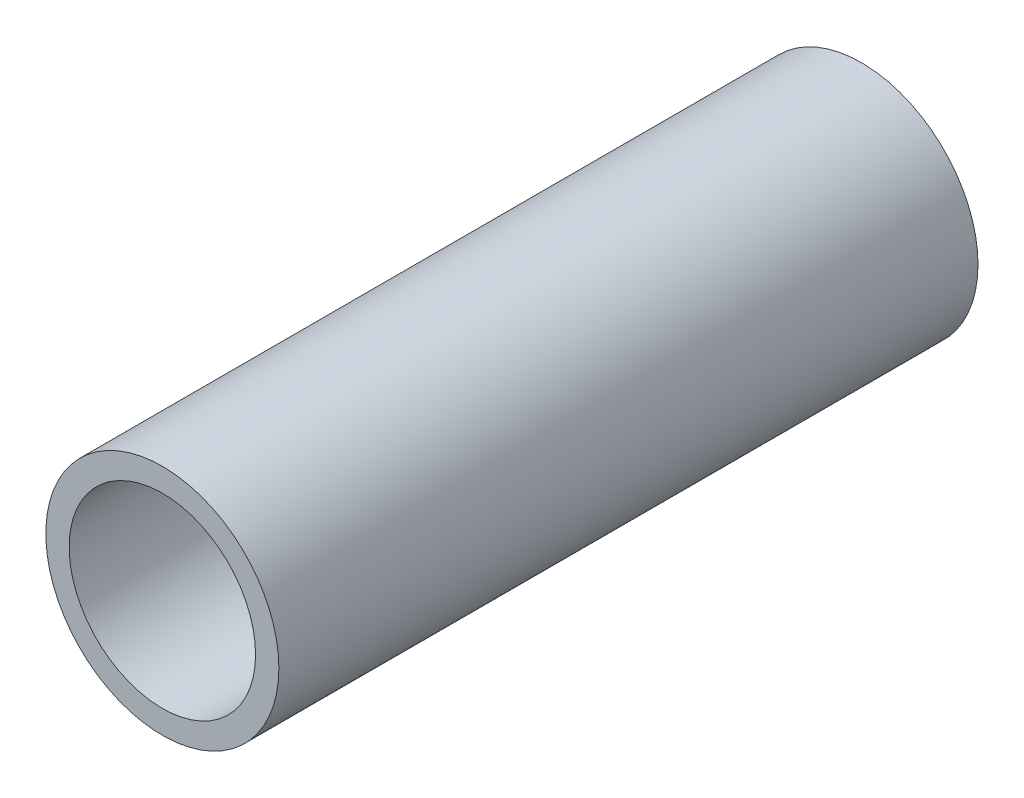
ISO-10303-21;
HEADER;
FILE_DESCRIPTION(('STEP AP214'),'2;1');
FILE_NAME('part.step','',(''),(''),'','','');
FILE_SCHEMA(('AUTOMOTIVE_DESIGN { 1 0 10303 214 1 1 1 1 }'));
ENDSEC;
DATA;
#1=APPLICATION_CONTEXT('core data for automotive mechanical design processes');
#2=APPLICATION_PROTOCOL_DEFINITION('international standard','automotive_design',2000,#1);
#3=PRODUCT_CONTEXT('',#1,'mechanical');
#4=PRODUCT('Part','Part','',(#3));
#5=PRODUCT_RELATED_PRODUCT_CATEGORY('part','',(#4));
#6=PRODUCT_DEFINITION_FORMATION('','',#4);
#7=PRODUCT_DEFINITION_CONTEXT('part definition',#1,'design');
#8=PRODUCT_DEFINITION('design','',#6,#7);
#9=PRODUCT_DEFINITION_SHAPE('','',#8);
#10=(LENGTH_UNIT() NAMED_UNIT(*) SI_UNIT(.MILLI.,.METRE.));
#11=(NAMED_UNIT(*) PLANE_ANGLE_UNIT() SI_UNIT($,.RADIAN.));
#12=(NAMED_UNIT(*) SI_UNIT($,.STERADIAN.) SOLID_ANGLE_UNIT());
#13=UNCERTAINTY_MEASURE_WITH_UNIT(LENGTH_MEASURE(1.E-05),#10,'distance_accuracy_value','');
#14=(GEOMETRIC_REPRESENTATION_CONTEXT(3) GLOBAL_UNCERTAINTY_ASSIGNED_CONTEXT((#13)) GLOBAL_UNIT_ASSIGNED_CONTEXT((#10,
#11,#12)) REPRESENTATION_CONTEXT('',''));
#15=CARTESIAN_POINT('',(0.,0.,0.));
#16=DIRECTION('',(0.,0.,1.));
#17=DIRECTION('',(1.,0.,0.));
#18=AXIS2_PLACEMENT_3D('',#15,#16,#17);
#19=CARTESIAN_POINT('',(0.,0.,30.));
#20=DIRECTION('',(0.,0.,-1.));
#21=DIRECTION('',(-1.,0.,0.));
#22=AXIS2_PLACEMENT_3D('',#19,#20,#21);
#23=CYLINDRICAL_SURFACE('',#22,5.);
#24=CARTESIAN_POINT('',(0.,0.,30.));
#25=DIRECTION('',(0.,0.,1.));
#26=DIRECTION('',(1.,0.,0.));
#27=AXIS2_PLACEMENT_3D('',#24,#25,#26);
#28=CIRCLE('',#27,5.);
#29=CARTESIAN_POINT('',(5.,0.,30.));
#30=VERTEX_POINT('',#29);
#31=EDGE_CURVE('E10',#30,#30,#28,.T.);
#32=ORIENTED_EDGE('',*,*,#31,.F.);
#33=EDGE_LOOP('',(#32));
#34=FACE_BOUND('',#33,.T.);
#35=CARTESIAN_POINT('',(0.,0.,0.));
#36=DIRECTION('',(0.,0.,1.));
#37=DIRECTION('',(1.,0.,0.));
#38=AXIS2_PLACEMENT_3D('',#35,#36,#37);
#39=CIRCLE('',#38,5.);
#40=CARTESIAN_POINT('',(5.,0.,0.));
#41=VERTEX_POINT('',#40);
#42=EDGE_CURVE('E35',#41,#41,#39,.T.);
#43=ORIENTED_EDGE('',*,*,#42,.T.);
#44=EDGE_LOOP('',(#43));
#45=FACE_BOUND('',#44,.T.);
#46=ADVANCED_FACE('F32',(#34,#45),#23,.T.);
#47=CARTESIAN_POINT('',(0.,0.,30.));
#48=DIRECTION('',(0.,0.,1.));
#49=DIRECTION('',(1.,0.,0.));
#50=AXIS2_PLACEMENT_3D('',#47,#48,#49);
#51=PLANE('',#50);
#52=CARTESIAN_POINT('',(0.,0.,30.));
#53=DIRECTION('',(0.,0.,1.));
#54=DIRECTION('',(1.,0.,0.));
#55=AXIS2_PLACEMENT_3D('',#52,#53,#54);
#56=CIRCLE('',#55,4.);
#57=CARTESIAN_POINT('',(4.,0.,30.));
#58=VERTEX_POINT('',#57);
#59=EDGE_CURVE('E44',#58,#58,#56,.T.);
#60=ORIENTED_EDGE('',*,*,#59,.F.);
#61=EDGE_LOOP('',(#60));
#62=FACE_BOUND('',#61,.T.);
#63=ORIENTED_EDGE('',*,*,#31,.T.);
#64=EDGE_LOOP('',(#63));
#65=FACE_BOUND('',#64,.T.);
#66=ADVANCED_FACE('F59',(#62,#65),#51,.T.);
#67=CARTESIAN_POINT('',(0.,0.,0.));
#68=DIRECTION('',(0.,0.,1.));
#69=DIRECTION('',(1.,0.,0.));
#70=AXIS2_PLACEMENT_3D('',#67,#68,#69);
#71=PLANE('',#70);
#72=CARTESIAN_POINT('',(0.,0.,0.));
#73=DIRECTION('',(0.,0.,1.));
#74=DIRECTION('',(1.,0.,0.));
#75=AXIS2_PLACEMENT_3D('',#72,#73,#74);
#76=CIRCLE('',#75,4.);
#77=CARTESIAN_POINT('',(4.,0.,0.));
#78=VERTEX_POINT('',#77);
#79=EDGE_CURVE('E42',#78,#78,#76,.T.);
#80=ORIENTED_EDGE('',*,*,#79,.T.);
#81=EDGE_LOOP('',(#80));
#82=FACE_BOUND('',#81,.T.);
#83=ORIENTED_EDGE('',*,*,#42,.F.);
#84=EDGE_LOOP('',(#83));
#85=FACE_BOUND('',#84,.T.);
#86=ADVANCED_FACE('F50',(#82,#85),#71,.F.);
#87=CARTESIAN_POINT('',(0.,0.,0.));
#88=DIRECTION('',(0.,0.,1.));
#89=DIRECTION('',(1.,0.,0.));
#90=AXIS2_PLACEMENT_3D('',#87,#88,#89);
#91=CYLINDRICAL_SURFACE('',#90,4.);
#92=ORIENTED_EDGE('',*,*,#79,.F.);
#93=EDGE_LOOP('',(#92));
#94=FACE_BOUND('',#93,.T.);
#95=ORIENTED_EDGE('',*,*,#59,.T.);
#96=EDGE_LOOP('',(#95));
#97=FACE_BOUND('',#96,.T.);
#98=ADVANCED_FACE('F53',(#94,#97),#91,.F.);
#99=CLOSED_SHELL('',(#46,#66,#86,#98));
#100=MANIFOLD_SOLID_BREP('B2',#99);
#101=ADVANCED_BREP_SHAPE_REPRESENTATION('',(#18,#100),#14);
#102=SHAPE_DEFINITION_REPRESENTATION(#9,#101);
ENDSEC;
END-ISO-10303-21;
